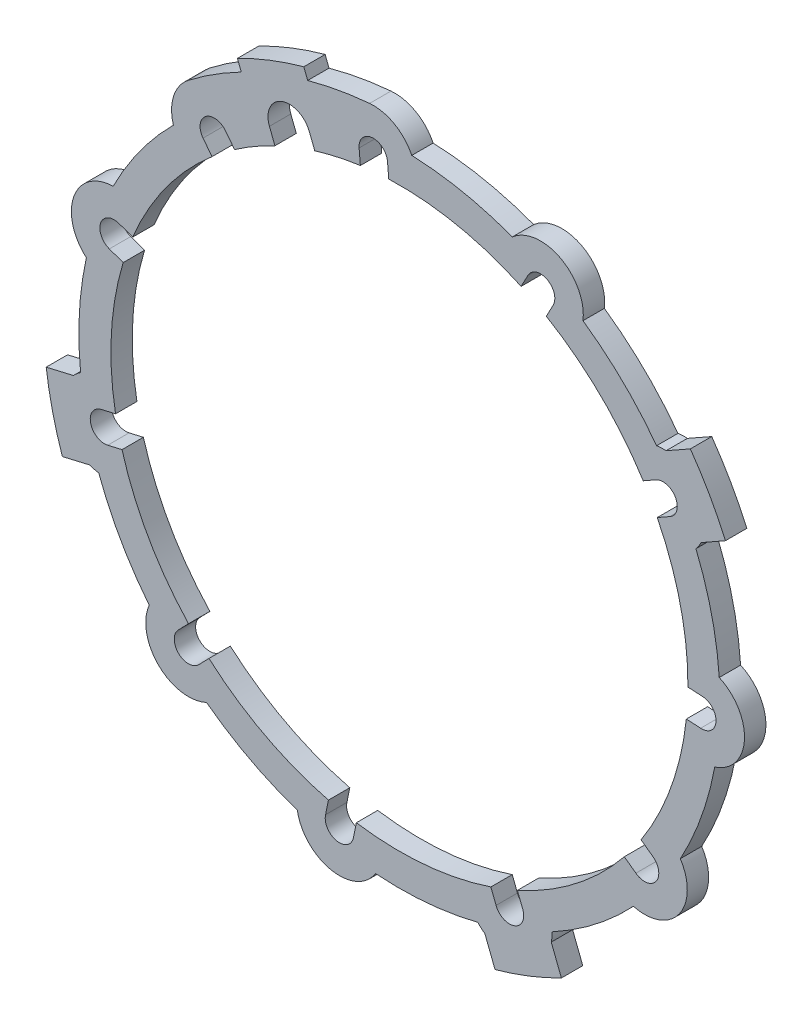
from build123d import *

# Parameters (mm, degrees)
EXTRUSION1_DEPTH = 3
EXTRUSION2_START = -3
EXTRUSION2_DEPTH = 3


with BuildPart() as part:
    # Esquisse1 → Extrusion1 (new body)
    with BuildSketch(Plane.XY):
        with BuildLine():
            ThreePointArc((25.770023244, 36.890458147), (22.609969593, 42.919937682), (15.850198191, 42.116163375))
            ThreePointArc((15.850198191, 42.116163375), (8.90717564, 44.109661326), (1.734635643, 44.966554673))
            ThreePointArc((1.734635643, 44.966554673), (-0.70122345, 47.569037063), (-4.183552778, 48.330421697))
            ThreePointArc((-4.183552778, 48.330421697), (-17.630343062, 45.194056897), (-29.648827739, 38.396338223))
            ThreePointArc((-29.648827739, 38.396338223), (-31.695686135, 35.478000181), (-31.725799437, 31.913533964))
            ThreePointArc((-31.725799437, 31.913533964), (-36.423384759, 26.426067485), (-40.182423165, 20.257661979))
            ThreePointArc((-40.182423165, 20.257661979), (-45.700808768, 16.271688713), (-43.943199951, 9.695111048))
            ThreePointArc((-43.943199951, 9.695111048), (-44.928311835, 2.539054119), (-44.755724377, -4.6824284))
            ThreePointArc((-44.755724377, -4.6824284), (-47.243105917, -11.019106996), (-42.208944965, -15.601441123))
            ThreePointArc((-42.208944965, -15.601441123), (-39.168817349, -22.15409099), (-35.119399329, -28.135880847))
            ThreePointArc((-35.119399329, -28.135880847), (-33.78605074, -34.811414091), (-27.073648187, -35.944645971))
            ThreePointArc((-27.073648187, -35.944645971), (-20.973500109, -39.813468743), (-14.332913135, -42.656389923))
            ThreePointArc((-14.332913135, -42.656389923), (-9.602163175, -47.551343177), (-3.342659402, -44.875679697))
            ThreePointArc((-3.342659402, -44.875679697), (3.880755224, -44.832351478), (11.004171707, -43.633796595))
            ThreePointArc((11.004171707, -43.633796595), (17.630343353, -45.194056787), (21.449600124, -39.559002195))
            ThreePointArc((21.449600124, -39.559002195), (27.502898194, -35.617279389), (32.847509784, -30.757781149))
            ThreePointArc((32.847509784, -30.757781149), (39.265340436, -28.487976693), (39.431763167, -21.682621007))
            ThreePointArc((39.431763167, -21.682621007), (42.393065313, -15.093972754), (44.261995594, -8.116387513))
            ThreePointArc((44.261995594, -8.116387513), (48.433869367, -2.737165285), (44.894620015, 3.077839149))
            ThreePointArc((44.894620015, 3.077839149), (43.823733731, 10.221563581), (41.623610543, 17.101901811))
            ThreePointArc((41.623610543, 17.101901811), (42.224986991, 23.882676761), (36.103752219, 26.861107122))
            ThreePointArc((36.103752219, 26.861107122), (31.340676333, 32.291825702), (25.770023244, 36.890458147))
        make_face()
        with BuildLine():
            Line((18.044015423, 38.543630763), (17.083632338, 36.72055972))
            ThreePointArc((17.083632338, 36.72055972), (8.016186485, 39.698750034), (-1.496423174, 40.472345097))
            Line((-1.496423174, 40.472345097), (-1.670064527, 42.478333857))
            ThreePointArc((-1.670064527, 42.478333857), (-3.815148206, 44.347214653), (-5.658668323, 42.180296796))
            Line((-5.658668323, 42.180296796), (-5.480967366, 40.127409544))
            ThreePointArc((-5.480967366, 40.127409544), (-8.710842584, 39.552132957), (-11.883558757, 38.717322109))
            Line((-11.883558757, 38.717322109), (-12.654905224, 40.694610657))
            ThreePointArc((-12.654905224, 40.694610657), (-16.540057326, 42.399190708), (-18.244637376, 38.514038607))
            Line((-18.244637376, 38.514038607), (-17.473290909, 36.536750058))
            ThreePointArc((-17.473290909, 36.536750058), (-20.373436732, 35.002472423), (-23.139873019, 33.238475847))
            Line((-23.139873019, 33.238475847), (-24.370468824, 34.832143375))
            ThreePointArc((-24.370468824, 34.832143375), (-27.185421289, 35.244626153), (-27.564764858, 32.425016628))
            Line((-27.564764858, 32.425016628), (-26.305398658, 30.794090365))
            ThreePointArc((-26.305398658, 30.794090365), (-32.781208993, 23.783236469), (-37.43657668, 15.451625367))
            Line((-37.43657668, 15.451625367), (-39.333421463, 16.126993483))
            ThreePointArc((-39.333421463, 16.126993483), (-41.924515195, 14.952117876), (-40.719243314, 12.375022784))
            Line((-40.719243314, 12.375022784), (-38.778051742, 11.683865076))
            ThreePointArc((-38.778051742, 11.683865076), (-40.435496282, 2.284872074), (-39.847431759, -7.241006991))
            Line((-39.847431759, -7.241006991), (-41.808290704, -7.698362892))
            ThreePointArc((-41.808290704, -7.698362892), (-43.352871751, -10.08758218), (-40.945649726, -11.603953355))
            Line((-40.945649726, -11.603953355), (-38.93894739, -11.135904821))
            ThreePointArc((-38.93894739, -11.135904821), (-35.251799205, -19.93892306), (-29.607008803, -27.634670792))
            Line((-29.607008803, -27.634670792), (-31.009323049, -29.079543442))
            ThreePointArc((-31.009323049, -29.079543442), (-31.016997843, -31.924546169), (-28.172101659, -31.898756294))
            Line((-28.172101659, -31.898756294), (-26.737002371, -30.42010362))
            ThreePointArc((-26.737002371, -30.42010362), (-18.875904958, -35.832251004), (-9.966569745, -39.254521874))
            Line((-9.966569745, -39.254521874), (-10.365114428, -41.228174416))
            ThreePointArc((-10.365114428, -41.228174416), (-8.833446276, -43.625692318), (-6.454110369, -42.065929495))
            Line((-6.454110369, -42.065929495), (-6.046248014, -40.046134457))
            ThreePointArc((-6.046248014, -40.046134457), (3.492955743, -40.349092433), (12.838184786, -38.41133962))
            Line((12.838184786, -38.41133962), (13.569944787, -40.287151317))
            ThreePointArc((13.569944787, -40.287151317), (16.15466207, -41.4759894), (17.31301536, -38.877467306))
            Line((17.31301536, -38.877467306), (16.564147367, -36.957800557))
            ThreePointArc((16.564147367, -36.957800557), (24.752827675, -32.055382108), (31.566906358, -25.372828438))
            Line((31.566906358, -25.372828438), (33.196642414, -26.555242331))
            ThreePointArc((33.196642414, -26.555242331), (36.013779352, -26.157952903), (35.58338104, -23.345683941))
            Line((35.58338104, -23.345683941), (33.915542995, -22.135626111))
            ThreePointArc((33.915542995, -22.135626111), (38.153851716, -13.584314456), (40.273358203, -4.278623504))
            Line((40.273358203, -4.278623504), (42.28364063, -4.392231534))
            ThreePointArc((42.28364063, -4.392231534), (44.438776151, -2.534951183), (42.55627466, -0.401810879))
            Line((42.55627466, -0.401810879), (40.498993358, -0.285546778))
            ThreePointArc((40.498993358, -0.285546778), (39.441297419, 9.199677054), (36.193303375, 18.174014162))
            Line((36.193303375, 18.174014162), (37.945881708, 19.16528174))
            ThreePointArc((37.945881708, 19.16528174), (38.754775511, 21.892879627), (36.017851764, 22.669634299))
            Line((36.017851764, 22.669634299), (34.224299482, 21.655191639))
            ThreePointArc((34.224299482, 21.655191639), (28.206409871, 29.062836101), (20.622130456, 34.856530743))
            Line((20.622130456, 34.856530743), (21.560573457, 36.637953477))
            ThreePointArc((21.560573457, 36.637953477), (20.766407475, 39.369875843), (18.044015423, 38.543630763))
        make_face(mode=Mode.SUBTRACT)
    extrude(amount=-EXTRUSION1_DEPTH)

    # Esquisse2 → Extrusion2 (add)
    with BuildSketch(Plane(origin=(0, 0, -3), x_dir=(-1, 0, 0), z_dir=(0, 0, -1)).offset(EXTRUSION2_START)):
        with BuildLine():
            Line((-37.427762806, 26.913706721), (-40.84119121, 28.844359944))
            ThreePointArc((-40.84119121, 28.844359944), (-43.520908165, 24.615656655), (-45.764322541, 20.140178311))
            Line((-45.764322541, 20.140178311), (-42.350894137, 18.209525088))
            ThreePointArc((-42.350894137, 18.209525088), (-42.224986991, 23.88267676), (-37.427762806, 26.913706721))
        make_face()
        with BuildLine():
            Line((43.494142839, -15.278893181), (47.313231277, -16.169667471))
            ThreePointArc((47.313231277, -16.169667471), (48.693037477, -11.357292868), (49.584689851, -6.431059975))
            Line((49.584689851, -6.431059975), (45.765601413, -5.540285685))
            ThreePointArc((45.765601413, -5.540285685), (47.243105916, -11.019106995), (43.494142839, -15.278893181))
        make_face()
        with BuildLine():
            Line((13.422238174, 48.164753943), (12.878337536, 46.770505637))
            ThreePointArc((12.878337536, 46.770505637), (17.630343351, 45.194056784), (22.194557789, 43.136218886))
            Line((22.194557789, 43.136218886), (22.738458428, 44.530467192))
            ThreePointArc((22.738458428, 44.530467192), (18.171433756, 46.581101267), (13.422238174, 48.164753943))
        make_face()
        with BuildLine():
            Line((-21.313237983, -40.877021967), (-22.738458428, -44.530467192))
            ThreePointArc((-22.738458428, -44.530467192), (-18.171433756, -46.581101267), (-13.422238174, -48.164753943))
            Line((-13.422238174, -48.164753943), (-11.997017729, -44.511308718))
            ThreePointArc((-11.997017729, -44.511308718), (-17.630343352, -45.194056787), (-21.313237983, -40.877021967))
        make_face()
    extrude(amount=EXTRUSION2_DEPTH)


solid = part.part
